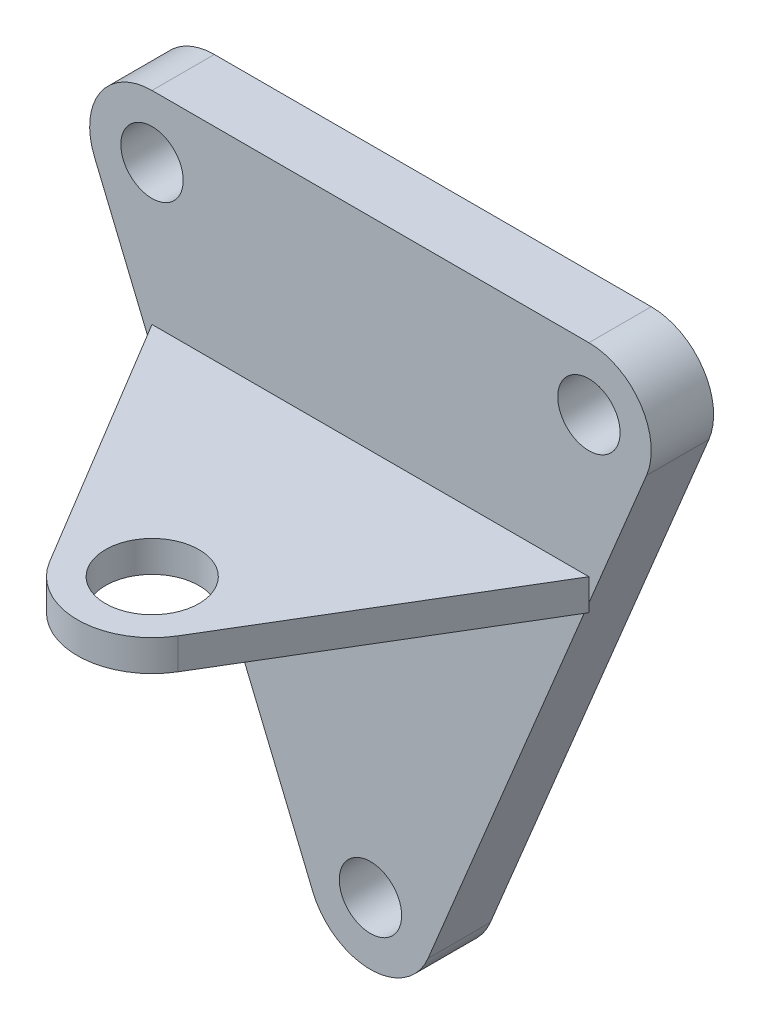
ISO-10303-21;
HEADER;
FILE_DESCRIPTION(('STEP AP214'),'2;1');
FILE_NAME('part.step','',(''),(''),'','','');
FILE_SCHEMA(('AUTOMOTIVE_DESIGN { 1 0 10303 214 1 1 1 1 }'));
ENDSEC;
DATA;
#1=APPLICATION_CONTEXT('core data for automotive mechanical design processes');
#2=APPLICATION_PROTOCOL_DEFINITION('international standard','automotive_design',2000,#1);
#3=PRODUCT_CONTEXT('',#1,'mechanical');
#4=PRODUCT('Part','Part','',(#3));
#5=PRODUCT_RELATED_PRODUCT_CATEGORY('part','',(#4));
#6=PRODUCT_DEFINITION_FORMATION('','',#4);
#7=PRODUCT_DEFINITION_CONTEXT('part definition',#1,'design');
#8=PRODUCT_DEFINITION('design','',#6,#7);
#9=PRODUCT_DEFINITION_SHAPE('','',#8);
#10=(LENGTH_UNIT() NAMED_UNIT(*) SI_UNIT(.MILLI.,.METRE.));
#11=(NAMED_UNIT(*) PLANE_ANGLE_UNIT() SI_UNIT($,.RADIAN.));
#12=(NAMED_UNIT(*) SI_UNIT($,.STERADIAN.) SOLID_ANGLE_UNIT());
#13=UNCERTAINTY_MEASURE_WITH_UNIT(LENGTH_MEASURE(1.E-05),#10,'distance_accuracy_value','');
#14=(GEOMETRIC_REPRESENTATION_CONTEXT(3) GLOBAL_UNCERTAINTY_ASSIGNED_CONTEXT((#13)) GLOBAL_UNIT_ASSIGNED_CONTEXT((#10,
#11,#12)) REPRESENTATION_CONTEXT('',''));
#15=CARTESIAN_POINT('',(0.,0.,0.));
#16=DIRECTION('',(0.,0.,1.));
#17=DIRECTION('',(1.,0.,0.));
#18=AXIS2_PLACEMENT_3D('',#15,#16,#17);
#19=CARTESIAN_POINT('',(0.,-94.579418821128,10.));
#20=DIRECTION('',(0.,0.,-1.));
#21=DIRECTION('',(-1.,0.,0.));
#22=AXIS2_PLACEMENT_3D('',#19,#20,#21);
#23=PLANE('',#22);
#24=CARTESIAN_POINT('',(35.0339423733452,-9.99999999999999,10.));
#25=DIRECTION('',(0.,0.,1.));
#26=DIRECTION('',(1.,0.,0.));
#27=AXIS2_PLACEMENT_3D('',#24,#25,#26);
#28=CIRCLE('',#27,5.);
#29=CARTESIAN_POINT('',(40.0339423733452,-9.99999999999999,10.));
#30=VERTEX_POINT('',#29);
#31=EDGE_CURVE('E187',#30,#30,#28,.T.);
#32=ORIENTED_EDGE('',*,*,#31,.F.);
#33=EDGE_LOOP('',(#32));
#34=FACE_BOUND('',#33,.T.);
#35=CARTESIAN_POINT('',(-35.0339423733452,-9.99999999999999,10.));
#36=DIRECTION('',(0.,0.,1.));
#37=DIRECTION('',(1.,0.,0.));
#38=AXIS2_PLACEMENT_3D('',#35,#36,#37);
#39=CIRCLE('',#38,5.);
#40=CARTESIAN_POINT('',(-30.0339423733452,-9.99999999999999,10.));
#41=VERTEX_POINT('',#40);
#42=EDGE_CURVE('E181',#41,#41,#39,.T.);
#43=ORIENTED_EDGE('',*,*,#42,.F.);
#44=EDGE_LOOP('',(#43));
#45=FACE_BOUND('',#44,.T.);
#46=DIRECTION('',(0.,1.,0.));
#47=VECTOR('',#46,1.);
#48=CARTESIAN_POINT('',(35.0339423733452,-37.5,10.));
#49=LINE('',#48,#47);
#50=CARTESIAN_POINT('',(35.0339423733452,-36.1312592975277,10.));
#51=VERTEX_POINT('',#50);
#52=CARTESIAN_POINT('',(35.0339423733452,-32.5,10.));
#53=VERTEX_POINT('',#52);
#54=EDGE_CURVE('E42',#51,#53,#49,.T.);
#55=ORIENTED_EDGE('',*,*,#54,.F.);
#56=DIRECTION('',(0.382683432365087,0.923879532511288,0.));
#57=VECTOR('',#56,1.);
#58=CARTESIAN_POINT('',(44.272737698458,-13.8268343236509,10.));
#59=LINE('',#58,#57);
#60=CARTESIAN_POINT('',(44.272737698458,-13.8268343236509,10.));
#61=VERTEX_POINT('',#60);
#62=EDGE_CURVE('E205',#51,#61,#59,.T.);
#63=ORIENTED_EDGE('',*,*,#62,.T.);
#64=CARTESIAN_POINT('',(35.0339423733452,-9.99999999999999,10.));
#65=DIRECTION('',(0.,0.,1.));
#66=DIRECTION('',(-1.,0.,0.));
#67=AXIS2_PLACEMENT_3D('',#64,#65,#66);
#68=CIRCLE('',#67,9.99999999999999);
#69=CARTESIAN_POINT('',(35.0339423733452,0.,10.));
#70=VERTEX_POINT('',#69);
#71=EDGE_CURVE('E209',#61,#70,#68,.T.);
#72=ORIENTED_EDGE('',*,*,#71,.T.);
#73=DIRECTION('',(-1.,0.,0.));
#74=VECTOR('',#73,1.);
#75=CARTESIAN_POINT('',(-35.0339423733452,0.,10.));
#76=LINE('',#75,#74);
#77=CARTESIAN_POINT('',(-35.0339423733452,0.,10.));
#78=VERTEX_POINT('',#77);
#79=EDGE_CURVE('E212',#70,#78,#76,.T.);
#80=ORIENTED_EDGE('',*,*,#79,.T.);
#81=CARTESIAN_POINT('',(-35.0339423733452,-9.99999999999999,10.));
#82=DIRECTION('',(0.,0.,1.));
#83=DIRECTION('',(1.,0.,0.));
#84=AXIS2_PLACEMENT_3D('',#81,#82,#83);
#85=CIRCLE('',#84,9.99999999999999);
#86=CARTESIAN_POINT('',(-44.272737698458,-13.8268343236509,10.));
#87=VERTEX_POINT('',#86);
#88=EDGE_CURVE('E214',#78,#87,#85,.T.);
#89=ORIENTED_EDGE('',*,*,#88,.T.);
#90=DIRECTION('',(0.382683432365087,-0.923879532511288,0.));
#91=VECTOR('',#90,1.);
#92=CARTESIAN_POINT('',(-9.23879532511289,-98.4062531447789,10.));
#93=LINE('',#92,#91);
#94=CARTESIAN_POINT('',(-35.0339423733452,-36.1312592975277,10.));
#95=VERTEX_POINT('',#94);
#96=EDGE_CURVE('E216',#87,#95,#93,.T.);
#97=ORIENTED_EDGE('',*,*,#96,.T.);
#98=DIRECTION('',(0.,1.,0.));
#99=VECTOR('',#98,1.);
#100=CARTESIAN_POINT('',(-35.0339423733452,-37.5,10.));
#101=LINE('',#100,#99);
#102=CARTESIAN_POINT('',(-35.0339423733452,-32.5,10.));
#103=VERTEX_POINT('',#102);
#104=EDGE_CURVE('E169',#95,#103,#101,.T.);
#105=ORIENTED_EDGE('',*,*,#104,.T.);
#106=DIRECTION('',(-1.,0.,0.));
#107=VECTOR('',#106,1.);
#108=CARTESIAN_POINT('',(-35.0339423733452,-32.5,10.));
#109=LINE('',#108,#107);
#110=EDGE_CURVE('E52',#53,#103,#109,.T.);
#111=ORIENTED_EDGE('',*,*,#110,.F.);
#112=EDGE_LOOP('',(#55,#63,#72,#80,#89,#97,#105,#111));
#113=FACE_BOUND('',#112,.T.);
#114=ADVANCED_FACE('F33',(#34,#45,#113),#23,.F.);
#115=CARTESIAN_POINT('',(9.23879532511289,-98.4062531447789,10.));
#116=VERTEX_POINT('',#115);
#117=CARTESIAN_POINT('',(34.4669914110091,-37.5,10.));
#118=VERTEX_POINT('',#117);
#119=EDGE_CURVE('E206',#116,#118,#59,.T.);
#120=ORIENTED_EDGE('',*,*,#119,.T.);
#121=DIRECTION('',(-1.,0.,0.));
#122=VECTOR('',#121,1.);
#123=CARTESIAN_POINT('',(-35.0339423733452,-37.5,10.));
#124=LINE('',#123,#122);
#125=CARTESIAN_POINT('',(-34.4669914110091,-37.5,10.));
#126=VERTEX_POINT('',#125);
#127=EDGE_CURVE('E11',#118,#126,#124,.T.);
#128=ORIENTED_EDGE('',*,*,#127,.T.);
#129=CARTESIAN_POINT('',(-9.23879532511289,-98.4062531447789,10.));
#130=VERTEX_POINT('',#129);
#131=EDGE_CURVE('E59',#126,#130,#93,.T.);
#132=ORIENTED_EDGE('',*,*,#131,.T.);
#133=CARTESIAN_POINT('',(0.,-94.579418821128,10.));
#134=DIRECTION('',(0.,0.,1.));
#135=DIRECTION('',(-1.,0.,0.));
#136=AXIS2_PLACEMENT_3D('',#133,#134,#135);
#137=CIRCLE('',#136,10.);
#138=EDGE_CURVE('E203',#130,#116,#137,.T.);
#139=ORIENTED_EDGE('',*,*,#138,.T.);
#140=EDGE_LOOP('',(#120,#128,#132,#139));
#141=FACE_BOUND('',#140,.T.);
#142=CARTESIAN_POINT('',(0.,-94.579418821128,10.));
#143=DIRECTION('',(0.,0.,1.));
#144=DIRECTION('',(1.,0.,0.));
#145=AXIS2_PLACEMENT_3D('',#142,#143,#144);
#146=CIRCLE('',#145,5.);
#147=CARTESIAN_POINT('',(5.,-94.579418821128,10.));
#148=VERTEX_POINT('',#147);
#149=EDGE_CURVE('E175',#148,#148,#146,.T.);
#150=ORIENTED_EDGE('',*,*,#149,.F.);
#151=EDGE_LOOP('',(#150));
#152=FACE_BOUND('',#151,.T.);
#153=ADVANCED_FACE('F246',(#141,#152),#23,.F.);
#154=CARTESIAN_POINT('',(0.,-94.579418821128,0.));
#155=DIRECTION('',(0.,0.,-1.));
#156=DIRECTION('',(-1.,0.,0.));
#157=AXIS2_PLACEMENT_3D('',#154,#155,#156);
#158=PLANE('',#157);
#159=CARTESIAN_POINT('',(-35.0339423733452,-9.99999999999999,0.));
#160=DIRECTION('',(0.,0.,1.));
#161=DIRECTION('',(1.,0.,0.));
#162=AXIS2_PLACEMENT_3D('',#159,#160,#161);
#163=CIRCLE('',#162,5.);
#164=CARTESIAN_POINT('',(-30.0339423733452,-9.99999999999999,0.));
#165=VERTEX_POINT('',#164);
#166=EDGE_CURVE('E178',#165,#165,#163,.T.);
#167=ORIENTED_EDGE('',*,*,#166,.T.);
#168=EDGE_LOOP('',(#167));
#169=FACE_BOUND('',#168,.T.);
#170=CARTESIAN_POINT('',(0.,-94.579418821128,0.));
#171=DIRECTION('',(0.,0.,1.));
#172=DIRECTION('',(-1.,0.,0.));
#173=AXIS2_PLACEMENT_3D('',#170,#171,#172);
#174=CIRCLE('',#173,10.);
#175=CARTESIAN_POINT('',(-9.23879532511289,-98.4062531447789,0.));
#176=VERTEX_POINT('',#175);
#177=CARTESIAN_POINT('',(9.23879532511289,-98.4062531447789,0.));
#178=VERTEX_POINT('',#177);
#179=EDGE_CURVE('E190',#176,#178,#174,.T.);
#180=ORIENTED_EDGE('',*,*,#179,.F.);
#181=DIRECTION('',(0.382683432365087,-0.923879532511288,0.));
#182=VECTOR('',#181,1.);
#183=CARTESIAN_POINT('',(-9.23879532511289,-98.4062531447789,0.));
#184=LINE('',#183,#182);
#185=CARTESIAN_POINT('',(-44.272737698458,-13.8268343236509,0.));
#186=VERTEX_POINT('',#185);
#187=EDGE_CURVE('E201',#186,#176,#184,.T.);
#188=ORIENTED_EDGE('',*,*,#187,.F.);
#189=CARTESIAN_POINT('',(-35.0339423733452,-9.99999999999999,0.));
#190=DIRECTION('',(0.,0.,1.));
#191=DIRECTION('',(1.,0.,0.));
#192=AXIS2_PLACEMENT_3D('',#189,#190,#191);
#193=CIRCLE('',#192,9.99999999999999);
#194=CARTESIAN_POINT('',(-35.0339423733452,0.,0.));
#195=VERTEX_POINT('',#194);
#196=EDGE_CURVE('E199',#195,#186,#193,.T.);
#197=ORIENTED_EDGE('',*,*,#196,.F.);
#198=DIRECTION('',(-1.,0.,0.));
#199=VECTOR('',#198,1.);
#200=CARTESIAN_POINT('',(-35.0339423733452,0.,0.));
#201=LINE('',#200,#199);
#202=CARTESIAN_POINT('',(35.0339423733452,0.,0.));
#203=VERTEX_POINT('',#202);
#204=EDGE_CURVE('E197',#203,#195,#201,.T.);
#205=ORIENTED_EDGE('',*,*,#204,.F.);
#206=CARTESIAN_POINT('',(35.0339423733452,-9.99999999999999,0.));
#207=DIRECTION('',(0.,0.,1.));
#208=DIRECTION('',(-1.,0.,0.));
#209=AXIS2_PLACEMENT_3D('',#206,#207,#208);
#210=CIRCLE('',#209,9.99999999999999);
#211=CARTESIAN_POINT('',(44.272737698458,-13.8268343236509,0.));
#212=VERTEX_POINT('',#211);
#213=EDGE_CURVE('E195',#212,#203,#210,.T.);
#214=ORIENTED_EDGE('',*,*,#213,.F.);
#215=DIRECTION('',(0.382683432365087,0.923879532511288,0.));
#216=VECTOR('',#215,1.);
#217=CARTESIAN_POINT('',(44.272737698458,-13.8268343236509,0.));
#218=LINE('',#217,#216);
#219=EDGE_CURVE('E193',#178,#212,#218,.T.);
#220=ORIENTED_EDGE('',*,*,#219,.F.);
#221=EDGE_LOOP('',(#180,#188,#197,#205,#214,#220));
#222=FACE_BOUND('',#221,.T.);
#223=CARTESIAN_POINT('',(35.0339423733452,-9.99999999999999,0.));
#224=DIRECTION('',(0.,0.,1.));
#225=DIRECTION('',(1.,0.,0.));
#226=AXIS2_PLACEMENT_3D('',#223,#224,#225);
#227=CIRCLE('',#226,5.);
#228=CARTESIAN_POINT('',(40.0339423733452,-9.99999999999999,0.));
#229=VERTEX_POINT('',#228);
#230=EDGE_CURVE('E184',#229,#229,#227,.T.);
#231=ORIENTED_EDGE('',*,*,#230,.T.);
#232=EDGE_LOOP('',(#231));
#233=FACE_BOUND('',#232,.T.);
#234=CARTESIAN_POINT('',(0.,-94.579418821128,0.));
#235=DIRECTION('',(0.,0.,1.));
#236=DIRECTION('',(1.,0.,0.));
#237=AXIS2_PLACEMENT_3D('',#234,#235,#236);
#238=CIRCLE('',#237,5.);
#239=CARTESIAN_POINT('',(5.,-94.579418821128,0.));
#240=VERTEX_POINT('',#239);
#241=EDGE_CURVE('E167',#240,#240,#238,.T.);
#242=ORIENTED_EDGE('',*,*,#241,.T.);
#243=EDGE_LOOP('',(#242));
#244=FACE_BOUND('',#243,.T.);
#245=ADVANCED_FACE('F252',(#169,#222,#233,#244),#158,.T.);
#246=CARTESIAN_POINT('',(0.,-94.579418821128,10.));
#247=DIRECTION('',(0.,0.,-1.));
#248=DIRECTION('',(-1.,0.,0.));
#249=AXIS2_PLACEMENT_3D('',#246,#247,#248);
#250=CYLINDRICAL_SURFACE('',#249,10.);
#251=ORIENTED_EDGE('',*,*,#179,.T.);
#252=DIRECTION('',(0.,0.,-1.));
#253=VECTOR('',#252,1.);
#254=CARTESIAN_POINT('',(9.23879532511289,-98.4062531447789,10.));
#255=LINE('',#254,#253);
#256=EDGE_CURVE('E37',#116,#178,#255,.T.);
#257=ORIENTED_EDGE('',*,*,#256,.F.);
#258=ORIENTED_EDGE('',*,*,#138,.F.);
#259=DIRECTION('',(0.,0.,-1.));
#260=VECTOR('',#259,1.);
#261=CARTESIAN_POINT('',(-9.23879532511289,-98.4062531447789,10.));
#262=LINE('',#261,#260);
#263=EDGE_CURVE('E219',#130,#176,#262,.T.);
#264=ORIENTED_EDGE('',*,*,#263,.T.);
#265=EDGE_LOOP('',(#251,#257,#258,#264));
#266=FACE_BOUND('',#265,.T.);
#267=ADVANCED_FACE('F35',(#266),#250,.T.);
#268=CARTESIAN_POINT('',(44.272737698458,-13.8268343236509,10.));
#269=DIRECTION('',(-0.923879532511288,0.382683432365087,0.));
#270=DIRECTION('',(-0.382683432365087,-0.923879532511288,0.));
#271=AXIS2_PLACEMENT_3D('',#268,#269,#270);
#272=PLANE('',#271);
#273=ORIENTED_EDGE('',*,*,#219,.T.);
#274=DIRECTION('',(0.,0.,-1.));
#275=VECTOR('',#274,1.);
#276=CARTESIAN_POINT('',(44.272737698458,-13.8268343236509,10.));
#277=LINE('',#276,#275);
#278=EDGE_CURVE('E231',#61,#212,#277,.T.);
#279=ORIENTED_EDGE('',*,*,#278,.F.);
#280=ORIENTED_EDGE('',*,*,#62,.F.);
#281=EDGE_CURVE('E210',#118,#51,#59,.T.);
#282=ORIENTED_EDGE('',*,*,#281,.F.);
#283=ORIENTED_EDGE('',*,*,#119,.F.);
#284=ORIENTED_EDGE('',*,*,#256,.T.);
#285=EDGE_LOOP('',(#273,#279,#280,#282,#283,#284));
#286=FACE_BOUND('',#285,.T.);
#287=ADVANCED_FACE('F273',(#286),#272,.F.);
#288=CARTESIAN_POINT('',(35.0339423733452,-9.99999999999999,10.));
#289=DIRECTION('',(0.,0.,-1.));
#290=DIRECTION('',(-1.,0.,0.));
#291=AXIS2_PLACEMENT_3D('',#288,#289,#290);
#292=CYLINDRICAL_SURFACE('',#291,9.99999999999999);
#293=ORIENTED_EDGE('',*,*,#213,.T.);
#294=DIRECTION('',(0.,0.,-1.));
#295=VECTOR('',#294,1.);
#296=CARTESIAN_POINT('',(35.0339423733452,0.,10.));
#297=LINE('',#296,#295);
#298=EDGE_CURVE('E229',#70,#203,#297,.T.);
#299=ORIENTED_EDGE('',*,*,#298,.F.);
#300=ORIENTED_EDGE('',*,*,#71,.F.);
#301=ORIENTED_EDGE('',*,*,#278,.T.);
#302=EDGE_LOOP('',(#293,#299,#300,#301));
#303=FACE_BOUND('',#302,.T.);
#304=ADVANCED_FACE('F270',(#303),#292,.T.);
#305=CARTESIAN_POINT('',(-35.0339423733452,0.,10.));
#306=DIRECTION('',(0.,-1.,0.));
#307=DIRECTION('',(0.,0.,-1.));
#308=AXIS2_PLACEMENT_3D('',#305,#306,#307);
#309=PLANE('',#308);
#310=ORIENTED_EDGE('',*,*,#204,.T.);
#311=DIRECTION('',(0.,0.,-1.));
#312=VECTOR('',#311,1.);
#313=CARTESIAN_POINT('',(-35.0339423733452,0.,10.));
#314=LINE('',#313,#312);
#315=EDGE_CURVE('E226',#78,#195,#314,.T.);
#316=ORIENTED_EDGE('',*,*,#315,.F.);
#317=ORIENTED_EDGE('',*,*,#79,.F.);
#318=ORIENTED_EDGE('',*,*,#298,.T.);
#319=EDGE_LOOP('',(#310,#316,#317,#318));
#320=FACE_BOUND('',#319,.T.);
#321=ADVANCED_FACE('F266',(#320),#309,.F.);
#322=CARTESIAN_POINT('',(-35.0339423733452,-9.99999999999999,10.));
#323=DIRECTION('',(0.,0.,-1.));
#324=DIRECTION('',(-1.,0.,0.));
#325=AXIS2_PLACEMENT_3D('',#322,#323,#324);
#326=CYLINDRICAL_SURFACE('',#325,9.99999999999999);
#327=ORIENTED_EDGE('',*,*,#196,.T.);
#328=DIRECTION('',(0.,0.,-1.));
#329=VECTOR('',#328,1.);
#330=CARTESIAN_POINT('',(-44.272737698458,-13.8268343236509,10.));
#331=LINE('',#330,#329);
#332=EDGE_CURVE('E223',#87,#186,#331,.T.);
#333=ORIENTED_EDGE('',*,*,#332,.F.);
#334=ORIENTED_EDGE('',*,*,#88,.F.);
#335=ORIENTED_EDGE('',*,*,#315,.T.);
#336=EDGE_LOOP('',(#327,#333,#334,#335));
#337=FACE_BOUND('',#336,.T.);
#338=ADVANCED_FACE('F262',(#337),#326,.T.);
#339=CARTESIAN_POINT('',(-9.23879532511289,-98.4062531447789,10.));
#340=DIRECTION('',(0.923879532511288,0.382683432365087,0.));
#341=DIRECTION('',(-0.382683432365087,0.923879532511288,0.));
#342=AXIS2_PLACEMENT_3D('',#339,#340,#341);
#343=PLANE('',#342);
#344=ORIENTED_EDGE('',*,*,#187,.T.);
#345=ORIENTED_EDGE('',*,*,#263,.F.);
#346=ORIENTED_EDGE('',*,*,#131,.F.);
#347=EDGE_CURVE('E220',#95,#126,#93,.T.);
#348=ORIENTED_EDGE('',*,*,#347,.F.);
#349=ORIENTED_EDGE('',*,*,#96,.F.);
#350=ORIENTED_EDGE('',*,*,#332,.T.);
#351=EDGE_LOOP('',(#344,#345,#346,#348,#349,#350));
#352=FACE_BOUND('',#351,.T.);
#353=ADVANCED_FACE('F258',(#352),#343,.F.);
#354=CARTESIAN_POINT('',(35.0339423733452,-9.99999999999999,10.));
#355=DIRECTION('',(0.,0.,-1.));
#356=DIRECTION('',(-1.,0.,0.));
#357=AXIS2_PLACEMENT_3D('',#354,#355,#356);
#358=CYLINDRICAL_SURFACE('',#357,5.);
#359=ORIENTED_EDGE('',*,*,#31,.T.);
#360=EDGE_LOOP('',(#359));
#361=FACE_BOUND('',#360,.T.);
#362=ORIENTED_EDGE('',*,*,#230,.F.);
#363=EDGE_LOOP('',(#362));
#364=FACE_BOUND('',#363,.T.);
#365=ADVANCED_FACE('F261',(#361,#364),#358,.F.);
#366=CARTESIAN_POINT('',(-35.0339423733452,-9.99999999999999,10.));
#367=DIRECTION('',(0.,0.,-1.));
#368=DIRECTION('',(-1.,0.,0.));
#369=AXIS2_PLACEMENT_3D('',#366,#367,#368);
#370=CYLINDRICAL_SURFACE('',#369,5.);
#371=ORIENTED_EDGE('',*,*,#42,.T.);
#372=EDGE_LOOP('',(#371));
#373=FACE_BOUND('',#372,.T.);
#374=ORIENTED_EDGE('',*,*,#166,.F.);
#375=EDGE_LOOP('',(#374));
#376=FACE_BOUND('',#375,.T.);
#377=ADVANCED_FACE('F326',(#373,#376),#370,.F.);
#378=CARTESIAN_POINT('',(0.,-94.579418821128,10.));
#379=DIRECTION('',(0.,0.,-1.));
#380=DIRECTION('',(-1.,0.,0.));
#381=AXIS2_PLACEMENT_3D('',#378,#379,#380);
#382=CYLINDRICAL_SURFACE('',#381,5.);
#383=ORIENTED_EDGE('',*,*,#149,.T.);
#384=EDGE_LOOP('',(#383));
#385=FACE_BOUND('',#384,.T.);
#386=ORIENTED_EDGE('',*,*,#241,.F.);
#387=EDGE_LOOP('',(#386));
#388=FACE_BOUND('',#387,.T.);
#389=ADVANCED_FACE('F323',(#385,#388),#382,.F.);
#390=CARTESIAN_POINT('',(-35.0339423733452,-37.5,10.));
#391=DIRECTION('',(0.,0.,-1.));
#392=DIRECTION('',(-1.,0.,0.));
#393=AXIS2_PLACEMENT_3D('',#390,#391,#392);
#394=PLANE('',#393);
#395=CARTESIAN_POINT('',(35.0339423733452,-37.5,10.));
#396=VERTEX_POINT('',#395);
#397=EDGE_CURVE('E44',#396,#118,#124,.T.);
#398=ORIENTED_EDGE('',*,*,#397,.T.);
#399=ORIENTED_EDGE('',*,*,#281,.T.);
#400=EDGE_CURVE('E168',#396,#51,#49,.T.);
#401=ORIENTED_EDGE('',*,*,#400,.F.);
#402=EDGE_LOOP('',(#398,#399,#401));
#403=FACE_BOUND('',#402,.T.);
#404=ADVANCED_FACE('F292',(#403),#394,.T.);
#405=CARTESIAN_POINT('',(-10.2855422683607,-37.5,51.1812312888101));
#406=DIRECTION('',(-0.857128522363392,0.,0.515102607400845));
#407=DIRECTION('',(0.515102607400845,0.,0.857128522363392));
#408=AXIS2_PLACEMENT_3D('',#405,#406,#407);
#409=PLANE('',#408);
#410=DIRECTION('',(0.515102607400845,0.,0.857128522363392));
#411=VECTOR('',#410,1.);
#412=CARTESIAN_POINT('',(-10.2855422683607,-32.5,51.1812312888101));
#413=LINE('',#412,#411);
#414=CARTESIAN_POINT('',(-10.2855422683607,-32.5,51.1812312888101));
#415=VERTEX_POINT('',#414);
#416=EDGE_CURVE('E131',#103,#415,#413,.T.);
#417=ORIENTED_EDGE('',*,*,#416,.F.);
#418=ORIENTED_EDGE('',*,*,#104,.F.);
#419=CARTESIAN_POINT('',(-35.0339423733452,-37.5,10.));
#420=VERTEX_POINT('',#419);
#421=EDGE_CURVE('E164',#420,#95,#101,.T.);
#422=ORIENTED_EDGE('',*,*,#421,.F.);
#423=DIRECTION('',(0.515102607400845,0.,0.857128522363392));
#424=VECTOR('',#423,1.);
#425=CARTESIAN_POINT('',(-10.2855422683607,-37.5,51.1812312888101));
#426=LINE('',#425,#424);
#427=CARTESIAN_POINT('',(-10.2855422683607,-37.5,51.1812312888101));
#428=VERTEX_POINT('',#427);
#429=EDGE_CURVE('E135',#420,#428,#426,.T.);
#430=ORIENTED_EDGE('',*,*,#429,.T.);
#431=DIRECTION('',(0.,1.,0.));
#432=VECTOR('',#431,1.);
#433=CARTESIAN_POINT('',(-10.2855422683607,-37.5,51.1812312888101));
#434=LINE('',#433,#432);
#435=EDGE_CURVE('E128',#428,#415,#434,.T.);
#436=ORIENTED_EDGE('',*,*,#435,.T.);
#437=EDGE_LOOP('',(#417,#418,#422,#430,#436));
#438=FACE_BOUND('',#437,.T.);
#439=ADVANCED_FACE('F130',(#438),#409,.T.);
#440=ORIENTED_EDGE('',*,*,#421,.T.);
#441=ORIENTED_EDGE('',*,*,#347,.T.);
#442=EDGE_CURVE('E45',#126,#420,#124,.T.);
#443=ORIENTED_EDGE('',*,*,#442,.T.);
#444=EDGE_LOOP('',(#440,#441,#443));
#445=FACE_BOUND('',#444,.T.);
#446=ADVANCED_FACE('F300',(#445),#394,.T.);
#447=CARTESIAN_POINT('',(35.0339423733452,-37.5,10.));
#448=DIRECTION('',(0.857128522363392,0.,0.515102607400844));
#449=DIRECTION('',(0.515102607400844,0.,-0.857128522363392));
#450=AXIS2_PLACEMENT_3D('',#447,#448,#449);
#451=PLANE('',#450);
#452=DIRECTION('',(0.515102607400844,0.,-0.857128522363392));
#453=VECTOR('',#452,1.);
#454=CARTESIAN_POINT('',(35.0339423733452,-32.5,10.));
#455=LINE('',#454,#453);
#456=CARTESIAN_POINT('',(10.2855422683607,-32.5,51.1812312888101));
#457=VERTEX_POINT('',#456);
#458=EDGE_CURVE('E145',#457,#53,#455,.T.);
#459=ORIENTED_EDGE('',*,*,#458,.F.);
#460=DIRECTION('',(0.,1.,0.));
#461=VECTOR('',#460,1.);
#462=CARTESIAN_POINT('',(10.2855422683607,-37.5,51.1812312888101));
#463=LINE('',#462,#461);
#464=CARTESIAN_POINT('',(10.2855422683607,-37.5,51.1812312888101));
#465=VERTEX_POINT('',#464);
#466=EDGE_CURVE('E139',#465,#457,#463,.T.);
#467=ORIENTED_EDGE('',*,*,#466,.F.);
#468=DIRECTION('',(0.515102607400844,0.,-0.857128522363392));
#469=VECTOR('',#468,1.);
#470=CARTESIAN_POINT('',(35.0339423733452,-37.5,10.));
#471=LINE('',#470,#469);
#472=EDGE_CURVE('E160',#465,#396,#471,.T.);
#473=ORIENTED_EDGE('',*,*,#472,.T.);
#474=ORIENTED_EDGE('',*,*,#400,.T.);
#475=ORIENTED_EDGE('',*,*,#54,.T.);
#476=EDGE_LOOP('',(#459,#467,#473,#474,#475));
#477=FACE_BOUND('',#476,.T.);
#478=ADVANCED_FACE('F243',(#477),#451,.T.);
#479=CARTESIAN_POINT('',(0.,-37.5,45.));
#480=DIRECTION('',(0.,1.,0.));
#481=DIRECTION('',(0.,0.,1.));
#482=AXIS2_PLACEMENT_3D('',#479,#480,#481);
#483=CYLINDRICAL_SURFACE('',#482,12.);
#484=CARTESIAN_POINT('',(0.,-32.5,45.));
#485=DIRECTION('',(0.,1.,0.));
#486=DIRECTION('',(0.,0.,-1.));
#487=AXIS2_PLACEMENT_3D('',#484,#485,#486);
#488=CIRCLE('',#487,12.);
#489=EDGE_CURVE('E142',#415,#457,#488,.T.);
#490=ORIENTED_EDGE('',*,*,#489,.F.);
#491=ORIENTED_EDGE('',*,*,#435,.F.);
#492=CARTESIAN_POINT('',(0.,-37.5,45.));
#493=DIRECTION('',(0.,1.,0.));
#494=DIRECTION('',(0.,0.,-1.));
#495=AXIS2_PLACEMENT_3D('',#492,#493,#494);
#496=CIRCLE('',#495,12.);
#497=EDGE_CURVE('E158',#428,#465,#496,.T.);
#498=ORIENTED_EDGE('',*,*,#497,.T.);
#499=ORIENTED_EDGE('',*,*,#466,.T.);
#500=EDGE_LOOP('',(#490,#491,#498,#499));
#501=FACE_BOUND('',#500,.T.);
#502=ADVANCED_FACE('F143',(#501),#483,.T.);
#503=CARTESIAN_POINT('',(0.,-37.5,45.));
#504=DIRECTION('',(0.,-1.,0.));
#505=DIRECTION('',(0.,0.,-1.));
#506=AXIS2_PLACEMENT_3D('',#503,#504,#505);
#507=PLANE('',#506);
#508=CARTESIAN_POINT('',(0.,-37.5,45.));
#509=DIRECTION('',(0.,1.,0.));
#510=DIRECTION('',(0.,0.,1.));
#511=AXIS2_PLACEMENT_3D('',#508,#509,#510);
#512=CIRCLE('',#511,7.5);
#513=CARTESIAN_POINT('',(0.,-37.5,52.5));
#514=VERTEX_POINT('',#513);
#515=EDGE_CURVE('E148',#514,#514,#512,.T.);
#516=ORIENTED_EDGE('',*,*,#515,.T.);
#517=EDGE_LOOP('',(#516));
#518=FACE_BOUND('',#517,.T.);
#519=ORIENTED_EDGE('',*,*,#429,.F.);
#520=ORIENTED_EDGE('',*,*,#442,.F.);
#521=ORIENTED_EDGE('',*,*,#127,.F.);
#522=ORIENTED_EDGE('',*,*,#397,.F.);
#523=ORIENTED_EDGE('',*,*,#472,.F.);
#524=ORIENTED_EDGE('',*,*,#497,.F.);
#525=EDGE_LOOP('',(#519,#520,#521,#522,#523,#524));
#526=FACE_BOUND('',#525,.T.);
#527=ADVANCED_FACE('F302',(#518,#526),#507,.T.);
#528=CARTESIAN_POINT('',(0.,-32.5,45.));
#529=DIRECTION('',(0.,-1.,0.));
#530=DIRECTION('',(0.,0.,-1.));
#531=AXIS2_PLACEMENT_3D('',#528,#529,#530);
#532=PLANE('',#531);
#533=CARTESIAN_POINT('',(0.,-32.5,45.));
#534=DIRECTION('',(0.,1.,0.));
#535=DIRECTION('',(0.,0.,1.));
#536=AXIS2_PLACEMENT_3D('',#533,#534,#535);
#537=CIRCLE('',#536,7.5);
#538=CARTESIAN_POINT('',(0.,-32.5,52.5));
#539=VERTEX_POINT('',#538);
#540=EDGE_CURVE('E151',#539,#539,#537,.T.);
#541=ORIENTED_EDGE('',*,*,#540,.F.);
#542=EDGE_LOOP('',(#541));
#543=FACE_BOUND('',#542,.T.);
#544=ORIENTED_EDGE('',*,*,#416,.T.);
#545=ORIENTED_EDGE('',*,*,#489,.T.);
#546=ORIENTED_EDGE('',*,*,#458,.T.);
#547=ORIENTED_EDGE('',*,*,#110,.T.);
#548=EDGE_LOOP('',(#544,#545,#546,#547));
#549=FACE_BOUND('',#548,.T.);
#550=ADVANCED_FACE('F147',(#543,#549),#532,.F.);
#551=CARTESIAN_POINT('',(0.,-37.5,45.));
#552=DIRECTION('',(0.,1.,0.));
#553=DIRECTION('',(0.,0.,1.));
#554=AXIS2_PLACEMENT_3D('',#551,#552,#553);
#555=CYLINDRICAL_SURFACE('',#554,7.5);
#556=ORIENTED_EDGE('',*,*,#515,.F.);
#557=EDGE_LOOP('',(#556));
#558=FACE_BOUND('',#557,.T.);
#559=ORIENTED_EDGE('',*,*,#540,.T.);
#560=EDGE_LOOP('',(#559));
#561=FACE_BOUND('',#560,.T.);
#562=ADVANCED_FACE('F311',(#558,#561),#555,.F.);
#563=CLOSED_SHELL('',(#114,#153,#245,#267,#287,#304,#321,#338,#353,#365,#377,#389,#404,#439,
#446,#478,#502,#527,#550,#562));
#564=MANIFOLD_SOLID_BREP('B2',#563);
#565=ADVANCED_BREP_SHAPE_REPRESENTATION('',(#18,#564),#14);
#566=SHAPE_DEFINITION_REPRESENTATION(#9,#565);
ENDSEC;
END-ISO-10303-21;
